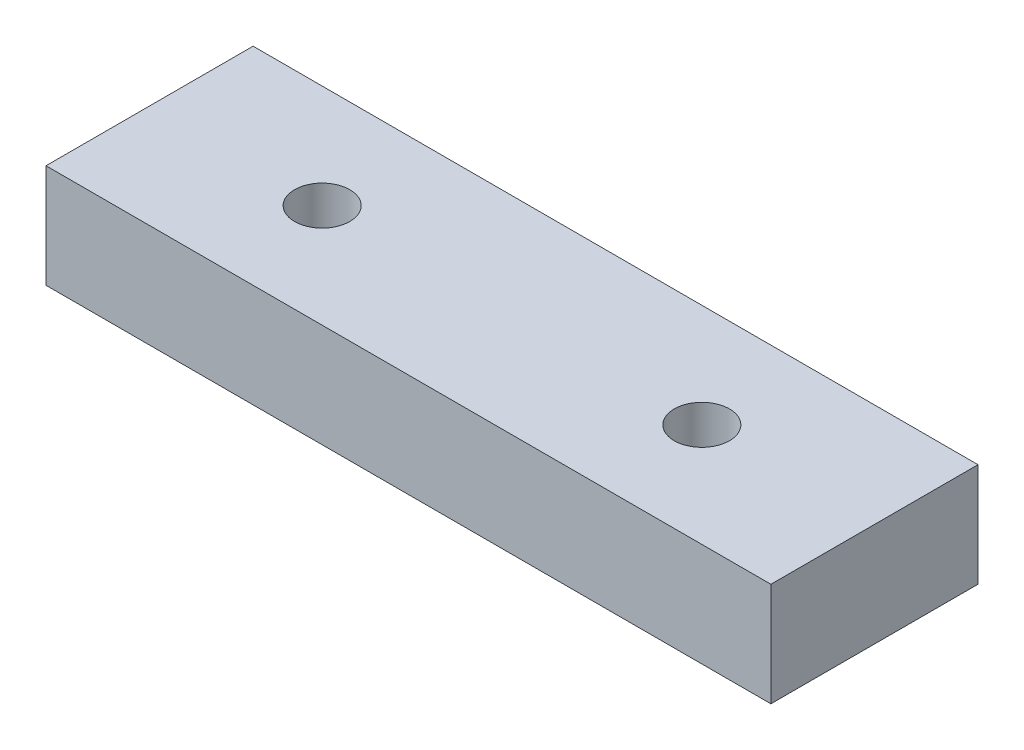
ISO-10303-21;
HEADER;
FILE_DESCRIPTION(('STEP AP214'),'2;1');
FILE_NAME('part.step','',(''),(''),'','','');
FILE_SCHEMA(('AUTOMOTIVE_DESIGN { 1 0 10303 214 1 1 1 1 }'));
ENDSEC;
DATA;
#1=APPLICATION_CONTEXT('core data for automotive mechanical design processes');
#2=APPLICATION_PROTOCOL_DEFINITION('international standard','automotive_design',2000,#1);
#3=PRODUCT_CONTEXT('',#1,'mechanical');
#4=PRODUCT('Part','Part','',(#3));
#5=PRODUCT_RELATED_PRODUCT_CATEGORY('part','',(#4));
#6=PRODUCT_DEFINITION_FORMATION('','',#4);
#7=PRODUCT_DEFINITION_CONTEXT('part definition',#1,'design');
#8=PRODUCT_DEFINITION('design','',#6,#7);
#9=PRODUCT_DEFINITION_SHAPE('','',#8);
#10=(LENGTH_UNIT() NAMED_UNIT(*) SI_UNIT(.MILLI.,.METRE.));
#11=(NAMED_UNIT(*) PLANE_ANGLE_UNIT() SI_UNIT($,.RADIAN.));
#12=(NAMED_UNIT(*) SI_UNIT($,.STERADIAN.) SOLID_ANGLE_UNIT());
#13=UNCERTAINTY_MEASURE_WITH_UNIT(LENGTH_MEASURE(1.E-05),#10,'distance_accuracy_value','');
#14=(GEOMETRIC_REPRESENTATION_CONTEXT(3) GLOBAL_UNCERTAINTY_ASSIGNED_CONTEXT((#13)) GLOBAL_UNIT_ASSIGNED_CONTEXT((#10,
#11,#12)) REPRESENTATION_CONTEXT('',''));
#15=CARTESIAN_POINT('',(0.,0.,0.));
#16=DIRECTION('',(0.,0.,1.));
#17=DIRECTION('',(1.,0.,0.));
#18=AXIS2_PLACEMENT_3D('',#15,#16,#17);
#19=CARTESIAN_POINT('',(0.,6.,0.));
#20=DIRECTION('',(0.,-1.,0.));
#21=DIRECTION('',(0.,0.,-1.));
#22=AXIS2_PLACEMENT_3D('',#19,#20,#21);
#23=PLANE('',#22);
#24=DIRECTION('',(0.,0.,1.));
#25=VECTOR('',#24,1.);
#26=CARTESIAN_POINT('',(0.,6.,0.));
#27=LINE('',#26,#25);
#28=CARTESIAN_POINT('',(0.,6.,-12.));
#29=VERTEX_POINT('',#28);
#30=CARTESIAN_POINT('',(0.,6.,0.));
#31=VERTEX_POINT('',#30);
#32=EDGE_CURVE('E87',#29,#31,#27,.T.);
#33=ORIENTED_EDGE('',*,*,#32,.T.);
#34=DIRECTION('',(1.,0.,0.));
#35=VECTOR('',#34,1.);
#36=CARTESIAN_POINT('',(0.,6.,0.));
#37=LINE('',#36,#35);
#38=CARTESIAN_POINT('',(42.,6.,0.));
#39=VERTEX_POINT('',#38);
#40=EDGE_CURVE('E82',#31,#39,#37,.T.);
#41=ORIENTED_EDGE('',*,*,#40,.T.);
#42=DIRECTION('',(0.,0.,-1.));
#43=VECTOR('',#42,1.);
#44=CARTESIAN_POINT('',(42.,6.,0.));
#45=LINE('',#44,#43);
#46=CARTESIAN_POINT('',(42.,6.,-12.));
#47=VERTEX_POINT('',#46);
#48=EDGE_CURVE('E85',#39,#47,#45,.T.);
#49=ORIENTED_EDGE('',*,*,#48,.T.);
#50=DIRECTION('',(-1.,0.,0.));
#51=VECTOR('',#50,1.);
#52=CARTESIAN_POINT('',(0.,6.,-12.));
#53=LINE('',#52,#51);
#54=EDGE_CURVE('E52',#47,#29,#53,.T.);
#55=ORIENTED_EDGE('',*,*,#54,.T.);
#56=EDGE_LOOP('',(#33,#41,#49,#55));
#57=FACE_BOUND('',#56,.T.);
#58=CARTESIAN_POINT('',(10.,6.,-6.));
#59=DIRECTION('',(0.,1.,0.));
#60=DIRECTION('',(0.,0.,1.));
#61=AXIS2_PLACEMENT_3D('',#58,#59,#60);
#62=CIRCLE('',#61,1.6);
#63=CARTESIAN_POINT('',(10.,6.,-4.4));
#64=VERTEX_POINT('',#63);
#65=EDGE_CURVE('E102',#64,#64,#62,.T.);
#66=ORIENTED_EDGE('',*,*,#65,.F.);
#67=EDGE_LOOP('',(#66));
#68=FACE_BOUND('',#67,.T.);
#69=CARTESIAN_POINT('',(32.,6.,-6.));
#70=DIRECTION('',(0.,1.,0.));
#71=DIRECTION('',(0.,0.,1.));
#72=AXIS2_PLACEMENT_3D('',#69,#70,#71);
#73=CIRCLE('',#72,1.6);
#74=CARTESIAN_POINT('',(32.,6.,-4.4));
#75=VERTEX_POINT('',#74);
#76=EDGE_CURVE('E117',#75,#75,#73,.T.);
#77=ORIENTED_EDGE('',*,*,#76,.F.);
#78=EDGE_LOOP('',(#77));
#79=FACE_BOUND('',#78,.T.);
#80=ADVANCED_FACE('F35',(#57,#68,#79),#23,.F.);
#81=CARTESIAN_POINT('',(0.,0.,0.));
#82=DIRECTION('',(0.,-1.,0.));
#83=DIRECTION('',(0.,0.,-1.));
#84=AXIS2_PLACEMENT_3D('',#81,#82,#83);
#85=PLANE('',#84);
#86=CARTESIAN_POINT('',(10.,0.,-6.));
#87=DIRECTION('',(0.,1.,0.));
#88=DIRECTION('',(0.,0.,1.));
#89=AXIS2_PLACEMENT_3D('',#86,#87,#88);
#90=CIRCLE('',#89,1.6);
#91=CARTESIAN_POINT('',(10.,0.,-4.4));
#92=VERTEX_POINT('',#91);
#93=EDGE_CURVE('E114',#92,#92,#90,.T.);
#94=ORIENTED_EDGE('',*,*,#93,.T.);
#95=EDGE_LOOP('',(#94));
#96=FACE_BOUND('',#95,.T.);
#97=DIRECTION('',(0.,0.,1.));
#98=VECTOR('',#97,1.);
#99=CARTESIAN_POINT('',(0.,0.,0.));
#100=LINE('',#99,#98);
#101=CARTESIAN_POINT('',(0.,0.,-12.));
#102=VERTEX_POINT('',#101);
#103=CARTESIAN_POINT('',(0.,0.,0.));
#104=VERTEX_POINT('',#103);
#105=EDGE_CURVE('E99',#102,#104,#100,.T.);
#106=ORIENTED_EDGE('',*,*,#105,.F.);
#107=DIRECTION('',(-1.,0.,0.));
#108=VECTOR('',#107,1.);
#109=CARTESIAN_POINT('',(0.,0.,-12.));
#110=LINE('',#109,#108);
#111=CARTESIAN_POINT('',(42.,0.,-12.));
#112=VERTEX_POINT('',#111);
#113=EDGE_CURVE('E75',#112,#102,#110,.T.);
#114=ORIENTED_EDGE('',*,*,#113,.F.);
#115=DIRECTION('',(0.,0.,-1.));
#116=VECTOR('',#115,1.);
#117=CARTESIAN_POINT('',(42.,0.,0.));
#118=LINE('',#117,#116);
#119=CARTESIAN_POINT('',(42.,0.,0.));
#120=VERTEX_POINT('',#119);
#121=EDGE_CURVE('E69',#120,#112,#118,.T.);
#122=ORIENTED_EDGE('',*,*,#121,.F.);
#123=DIRECTION('',(1.,0.,0.));
#124=VECTOR('',#123,1.);
#125=CARTESIAN_POINT('',(0.,0.,0.));
#126=LINE('',#125,#124);
#127=EDGE_CURVE('E91',#104,#120,#126,.T.);
#128=ORIENTED_EDGE('',*,*,#127,.F.);
#129=EDGE_LOOP('',(#106,#114,#122,#128));
#130=FACE_BOUND('',#129,.T.);
#131=CARTESIAN_POINT('',(32.,0.,-6.));
#132=DIRECTION('',(0.,1.,0.));
#133=DIRECTION('',(0.,0.,1.));
#134=AXIS2_PLACEMENT_3D('',#131,#132,#133);
#135=CIRCLE('',#134,1.6);
#136=CARTESIAN_POINT('',(32.,0.,-4.4));
#137=VERTEX_POINT('',#136);
#138=EDGE_CURVE('E120',#137,#137,#135,.T.);
#139=ORIENTED_EDGE('',*,*,#138,.T.);
#140=EDGE_LOOP('',(#139));
#141=FACE_BOUND('',#140,.T.);
#142=ADVANCED_FACE('F110',(#96,#130,#141),#85,.T.);
#143=CARTESIAN_POINT('',(0.,6.,0.));
#144=DIRECTION('',(1.,0.,0.));
#145=DIRECTION('',(0.,0.,-1.));
#146=AXIS2_PLACEMENT_3D('',#143,#144,#145);
#147=PLANE('',#146);
#148=ORIENTED_EDGE('',*,*,#105,.T.);
#149=DIRECTION('',(0.,-1.,0.));
#150=VECTOR('',#149,1.);
#151=CARTESIAN_POINT('',(0.,6.,0.));
#152=LINE('',#151,#150);
#153=EDGE_CURVE('E11',#31,#104,#152,.T.);
#154=ORIENTED_EDGE('',*,*,#153,.F.);
#155=ORIENTED_EDGE('',*,*,#32,.F.);
#156=DIRECTION('',(0.,-1.,0.));
#157=VECTOR('',#156,1.);
#158=CARTESIAN_POINT('',(0.,6.,-12.));
#159=LINE('',#158,#157);
#160=EDGE_CURVE('E95',#29,#102,#159,.T.);
#161=ORIENTED_EDGE('',*,*,#160,.T.);
#162=EDGE_LOOP('',(#148,#154,#155,#161));
#163=FACE_BOUND('',#162,.T.);
#164=ADVANCED_FACE('F37',(#163),#147,.F.);
#165=CARTESIAN_POINT('',(0.,6.,0.));
#166=DIRECTION('',(0.,0.,-1.));
#167=DIRECTION('',(-1.,0.,0.));
#168=AXIS2_PLACEMENT_3D('',#165,#166,#167);
#169=PLANE('',#168);
#170=ORIENTED_EDGE('',*,*,#127,.T.);
#171=DIRECTION('',(0.,-1.,0.));
#172=VECTOR('',#171,1.);
#173=CARTESIAN_POINT('',(42.,6.,0.));
#174=LINE('',#173,#172);
#175=EDGE_CURVE('E44',#39,#120,#174,.T.);
#176=ORIENTED_EDGE('',*,*,#175,.F.);
#177=ORIENTED_EDGE('',*,*,#40,.F.);
#178=ORIENTED_EDGE('',*,*,#153,.T.);
#179=EDGE_LOOP('',(#170,#176,#177,#178));
#180=FACE_BOUND('',#179,.T.);
#181=ADVANCED_FACE('F90',(#180),#169,.F.);
#182=CARTESIAN_POINT('',(42.,6.,0.));
#183=DIRECTION('',(-1.,0.,0.));
#184=DIRECTION('',(0.,0.,1.));
#185=AXIS2_PLACEMENT_3D('',#182,#183,#184);
#186=PLANE('',#185);
#187=ORIENTED_EDGE('',*,*,#121,.T.);
#188=DIRECTION('',(0.,-1.,0.));
#189=VECTOR('',#188,1.);
#190=CARTESIAN_POINT('',(42.,6.,-12.));
#191=LINE('',#190,#189);
#192=EDGE_CURVE('E92',#47,#112,#191,.T.);
#193=ORIENTED_EDGE('',*,*,#192,.F.);
#194=ORIENTED_EDGE('',*,*,#48,.F.);
#195=ORIENTED_EDGE('',*,*,#175,.T.);
#196=EDGE_LOOP('',(#187,#193,#194,#195));
#197=FACE_BOUND('',#196,.T.);
#198=ADVANCED_FACE('F93',(#197),#186,.F.);
#199=CARTESIAN_POINT('',(0.,6.,-12.));
#200=DIRECTION('',(0.,0.,1.));
#201=DIRECTION('',(1.,0.,0.));
#202=AXIS2_PLACEMENT_3D('',#199,#200,#201);
#203=PLANE('',#202);
#204=ORIENTED_EDGE('',*,*,#113,.T.);
#205=ORIENTED_EDGE('',*,*,#160,.F.);
#206=ORIENTED_EDGE('',*,*,#54,.F.);
#207=ORIENTED_EDGE('',*,*,#192,.T.);
#208=EDGE_LOOP('',(#204,#205,#206,#207));
#209=FACE_BOUND('',#208,.T.);
#210=ADVANCED_FACE('F107',(#209),#203,.F.);
#211=CARTESIAN_POINT('',(10.,6.,-6.));
#212=DIRECTION('',(0.,-1.,0.));
#213=DIRECTION('',(0.,0.,-1.));
#214=AXIS2_PLACEMENT_3D('',#211,#212,#213);
#215=CYLINDRICAL_SURFACE('',#214,1.6);
#216=ORIENTED_EDGE('',*,*,#65,.T.);
#217=EDGE_LOOP('',(#216));
#218=FACE_BOUND('',#217,.T.);
#219=ORIENTED_EDGE('',*,*,#93,.F.);
#220=EDGE_LOOP('',(#219));
#221=FACE_BOUND('',#220,.T.);
#222=ADVANCED_FACE('F137',(#218,#221),#215,.F.);
#223=CARTESIAN_POINT('',(32.,6.,-6.));
#224=DIRECTION('',(0.,-1.,0.));
#225=DIRECTION('',(0.,0.,-1.));
#226=AXIS2_PLACEMENT_3D('',#223,#224,#225);
#227=CYLINDRICAL_SURFACE('',#226,1.6);
#228=ORIENTED_EDGE('',*,*,#76,.T.);
#229=EDGE_LOOP('',(#228));
#230=FACE_BOUND('',#229,.T.);
#231=ORIENTED_EDGE('',*,*,#138,.F.);
#232=EDGE_LOOP('',(#231));
#233=FACE_BOUND('',#232,.T.);
#234=ADVANCED_FACE('F126',(#230,#233),#227,.F.);
#235=CLOSED_SHELL('',(#80,#142,#164,#181,#198,#210,#222,#234));
#236=MANIFOLD_SOLID_BREP('B2',#235);
#237=ADVANCED_BREP_SHAPE_REPRESENTATION('',(#18,#236),#14);
#238=SHAPE_DEFINITION_REPRESENTATION(#9,#237);
ENDSEC;
END-ISO-10303-21;
